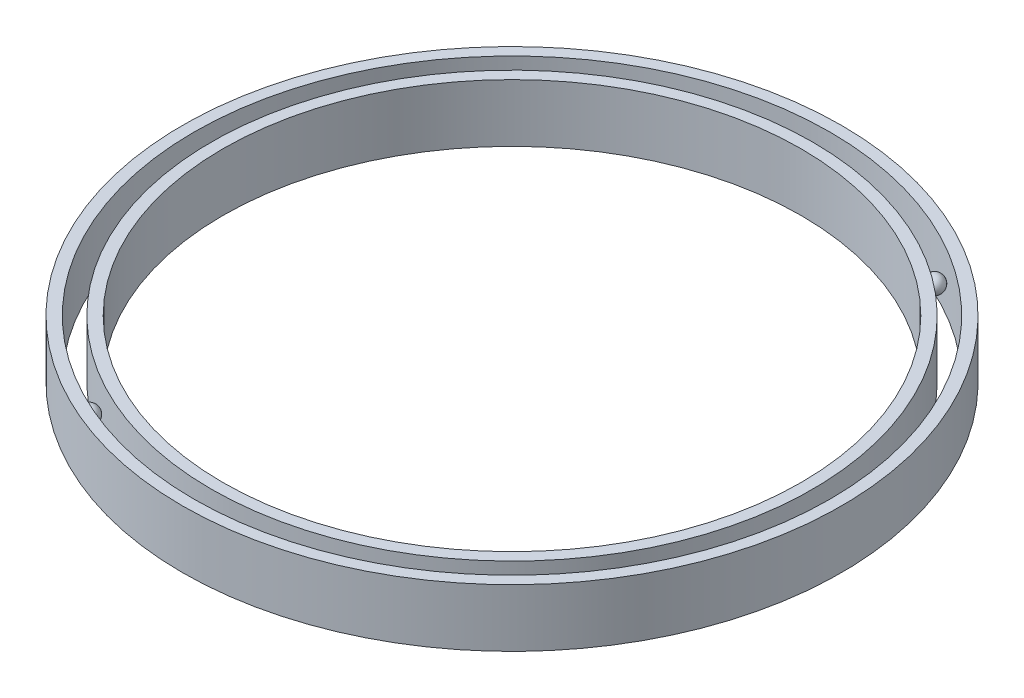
ISO-10303-21;
HEADER;
FILE_DESCRIPTION(('STEP AP214'),'2;1');
FILE_NAME('part.step','',(''),(''),'','','');
FILE_SCHEMA(('AUTOMOTIVE_DESIGN { 1 0 10303 214 1 1 1 1 }'));
ENDSEC;
DATA;
#1=APPLICATION_CONTEXT('core data for automotive mechanical design processes');
#2=APPLICATION_PROTOCOL_DEFINITION('international standard','automotive_design',2000,#1);
#3=PRODUCT_CONTEXT('',#1,'mechanical');
#4=PRODUCT('Part','Part','',(#3));
#5=PRODUCT_RELATED_PRODUCT_CATEGORY('part','',(#4));
#6=PRODUCT_DEFINITION_FORMATION('','',#4);
#7=PRODUCT_DEFINITION_CONTEXT('part definition',#1,'design');
#8=PRODUCT_DEFINITION('design','',#6,#7);
#9=PRODUCT_DEFINITION_SHAPE('','',#8);
#10=(LENGTH_UNIT() NAMED_UNIT(*) SI_UNIT(.MILLI.,.METRE.));
#11=(NAMED_UNIT(*) PLANE_ANGLE_UNIT() SI_UNIT($,.RADIAN.));
#12=(NAMED_UNIT(*) SI_UNIT($,.STERADIAN.) SOLID_ANGLE_UNIT());
#13=UNCERTAINTY_MEASURE_WITH_UNIT(LENGTH_MEASURE(1.E-05),#10,'distance_accuracy_value','');
#14=(GEOMETRIC_REPRESENTATION_CONTEXT(3) GLOBAL_UNCERTAINTY_ASSIGNED_CONTEXT((#13)) GLOBAL_UNIT_ASSIGNED_CONTEXT((#10,
#11,#12)) REPRESENTATION_CONTEXT('',''));
#15=CARTESIAN_POINT('',(0.,0.,0.));
#16=DIRECTION('',(0.,0.,1.));
#17=DIRECTION('',(1.,0.,0.));
#18=AXIS2_PLACEMENT_3D('',#15,#16,#17);
#19=CARTESIAN_POINT('',(53.5000000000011,0.,-92.6647182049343));
#20=DIRECTION('',(-0.50000000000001,0.,0.866025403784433));
#21=DIRECTION('',(0.866025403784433,0.,0.50000000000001));
#22=AXIS2_PLACEMENT_3D('',#19,#20,#21);
#23=SPHERICAL_SURFACE('',#22,3.);
#24=CARTESIAN_POINT('',(52.0000000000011,0.,-90.066641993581));
#25=VERTEX_POINT('',#24);
#26=VERTEX_LOOP('',#25);
#27=FACE_BOUND('',#26,.T.);
#28=ADVANCED_FACE('F36',(#27),#23,.T.);
#29=CLOSED_SHELL('',(#28));
#30=MANIFOLD_SOLID_BREP('B2',#29);
#31=CARTESIAN_POINT('',(-53.4999999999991,0.,-92.6647182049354));
#32=DIRECTION('',(0.499999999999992,0.,0.866025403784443));
#33=DIRECTION('',(0.866025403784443,0.,-0.499999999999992));
#34=AXIS2_PLACEMENT_3D('',#31,#32,#33);
#35=SPHERICAL_SURFACE('',#34,3.);
#36=CARTESIAN_POINT('',(-51.9999999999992,0.,-90.0666419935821));
#37=VERTEX_POINT('',#36);
#38=VERTEX_LOOP('',#37);
#39=FACE_BOUND('',#38,.T.);
#40=ADVANCED_FACE('F55',(#39),#35,.T.);
#41=CLOSED_SHELL('',(#40));
#42=MANIFOLD_SOLID_BREP('B6',#41);
#43=CARTESIAN_POINT('',(-107.,0.,0.));
#44=DIRECTION('',(1.,0.,0.));
#45=DIRECTION('',(0.,0.,-1.));
#46=AXIS2_PLACEMENT_3D('',#43,#44,#45);
#47=SPHERICAL_SURFACE('',#46,3.);
#48=CARTESIAN_POINT('',(-104.,0.,0.));
#49=VERTEX_POINT('',#48);
#50=VERTEX_LOOP('',#49);
#51=FACE_BOUND('',#50,.T.);
#52=ADVANCED_FACE('F74',(#51),#47,.T.);
#53=CLOSED_SHELL('',(#52));
#54=MANIFOLD_SOLID_BREP('B32',#53);
#55=CARTESIAN_POINT('',(-53.5000000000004,0.,92.6647182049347));
#56=DIRECTION('',(0.500000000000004,0.,-0.866025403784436));
#57=DIRECTION('',(-0.866025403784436,0.,-0.500000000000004));
#58=AXIS2_PLACEMENT_3D('',#55,#56,#57);
#59=SPHERICAL_SURFACE('',#58,3.);
#60=CARTESIAN_POINT('',(-52.0000000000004,0.,90.0666419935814));
#61=VERTEX_POINT('',#60);
#62=VERTEX_LOOP('',#61);
#63=FACE_BOUND('',#62,.T.);
#64=ADVANCED_FACE('F93',(#63),#59,.T.);
#65=CLOSED_SHELL('',(#64));
#66=MANIFOLD_SOLID_BREP('B51',#65);
#67=CARTESIAN_POINT('',(53.4999999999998,0.,92.6647182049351));
#68=DIRECTION('',(-0.499999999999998,0.,-0.86602540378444));
#69=DIRECTION('',(-0.86602540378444,0.,0.499999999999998));
#70=AXIS2_PLACEMENT_3D('',#67,#68,#69);
#71=SPHERICAL_SURFACE('',#70,3.);
#72=CARTESIAN_POINT('',(51.9999999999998,0.,90.0666419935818));
#73=VERTEX_POINT('',#72);
#74=VERTEX_LOOP('',#73);
#75=FACE_BOUND('',#74,.T.);
#76=ADVANCED_FACE('F112',(#75),#71,.T.);
#77=CLOSED_SHELL('',(#76));
#78=MANIFOLD_SOLID_BREP('B70',#77);
#79=CARTESIAN_POINT('',(107.,0.,0.));
#80=DIRECTION('',(-1.,0.,0.));
#81=DIRECTION('',(0.,0.,1.));
#82=AXIS2_PLACEMENT_3D('',#79,#80,#81);
#83=SPHERICAL_SURFACE('',#82,3.);
#84=CARTESIAN_POINT('',(104.,0.,0.));
#85=VERTEX_POINT('',#84);
#86=VERTEX_LOOP('',#85);
#87=FACE_BOUND('',#86,.T.);
#88=ADVANCED_FACE('F133',(#87),#83,.T.);
#89=CLOSED_SHELL('',(#88));
#90=MANIFOLD_SOLID_BREP('B89',#89);
#91=CARTESIAN_POINT('',(110.,10.,0.));
#92=DIRECTION('',(0.,1.,0.));
#93=DIRECTION('',(0.,0.,1.));
#94=AXIS2_PLACEMENT_3D('',#91,#92,#93);
#95=PLANE('',#94);
#96=CARTESIAN_POINT('',(0.,10.,0.));
#97=DIRECTION('',(0.,-1.,0.));
#98=DIRECTION('',(0.,0.,-1.));
#99=AXIS2_PLACEMENT_3D('',#96,#97,#98);
#100=CIRCLE('',#99,110.);
#101=CARTESIAN_POINT('',(0.,10.,-110.));
#102=VERTEX_POINT('',#101);
#103=EDGE_CURVE('E167',#102,#102,#100,.T.);
#104=ORIENTED_EDGE('',*,*,#103,.T.);
#105=EDGE_LOOP('',(#104));
#106=FACE_BOUND('',#105,.T.);
#107=CARTESIAN_POINT('',(0.,10.,0.));
#108=DIRECTION('',(0.,-1.,0.));
#109=DIRECTION('',(0.,0.,-1.));
#110=AXIS2_PLACEMENT_3D('',#107,#108,#109);
#111=CIRCLE('',#110,114.);
#112=CARTESIAN_POINT('',(0.,10.,-114.));
#113=VERTEX_POINT('',#112);
#114=EDGE_CURVE('E132',#113,#113,#111,.T.);
#115=ORIENTED_EDGE('',*,*,#114,.F.);
#116=EDGE_LOOP('',(#115));
#117=FACE_BOUND('',#116,.T.);
#118=ADVANCED_FACE('F153',(#106,#117),#95,.T.);
#119=CARTESIAN_POINT('',(0.,0.,0.));
#120=DIRECTION('',(0.,-1.,0.));
#121=DIRECTION('',(0.,0.,-1.));
#122=AXIS2_PLACEMENT_3D('',#119,#120,#121);
#123=CYLINDRICAL_SURFACE('',#122,114.);
#124=ORIENTED_EDGE('',*,*,#114,.T.);
#125=EDGE_LOOP('',(#124));
#126=FACE_BOUND('',#125,.T.);
#127=CARTESIAN_POINT('',(0.,-9.99999999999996,0.));
#128=DIRECTION('',(0.,-1.,0.));
#129=DIRECTION('',(0.,0.,-1.));
#130=AXIS2_PLACEMENT_3D('',#127,#128,#129);
#131=CIRCLE('',#130,114.);
#132=CARTESIAN_POINT('',(0.,-9.99999999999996,-114.));
#133=VERTEX_POINT('',#132);
#134=EDGE_CURVE('E159',#133,#133,#131,.T.);
#135=ORIENTED_EDGE('',*,*,#134,.F.);
#136=EDGE_LOOP('',(#135));
#137=FACE_BOUND('',#136,.T.);
#138=ADVANCED_FACE('F183',(#126,#137),#123,.T.);
#139=CARTESIAN_POINT('',(110.,-9.99999999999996,0.));
#140=DIRECTION('',(0.,-1.,0.));
#141=DIRECTION('',(0.,0.,-1.));
#142=AXIS2_PLACEMENT_3D('',#139,#140,#141);
#143=PLANE('',#142);
#144=ORIENTED_EDGE('',*,*,#134,.T.);
#145=EDGE_LOOP('',(#144));
#146=FACE_BOUND('',#145,.T.);
#147=CARTESIAN_POINT('',(0.,-9.99999999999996,0.));
#148=DIRECTION('',(0.,-1.,0.));
#149=DIRECTION('',(0.,0.,-1.));
#150=AXIS2_PLACEMENT_3D('',#147,#148,#149);
#151=CIRCLE('',#150,110.);
#152=CARTESIAN_POINT('',(0.,-9.99999999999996,-110.));
#153=VERTEX_POINT('',#152);
#154=EDGE_CURVE('E163',#153,#153,#151,.T.);
#155=ORIENTED_EDGE('',*,*,#154,.F.);
#156=EDGE_LOOP('',(#155));
#157=FACE_BOUND('',#156,.T.);
#158=ADVANCED_FACE('F177',(#146,#157),#143,.T.);
#159=CARTESIAN_POINT('',(0.,0.,0.));
#160=DIRECTION('',(0.,-1.,0.));
#161=DIRECTION('',(0.,0.,-1.));
#162=AXIS2_PLACEMENT_3D('',#159,#160,#161);
#163=CYLINDRICAL_SURFACE('',#162,110.);
#164=ORIENTED_EDGE('',*,*,#154,.T.);
#165=EDGE_LOOP('',(#164));
#166=FACE_BOUND('',#165,.T.);
#167=ORIENTED_EDGE('',*,*,#103,.F.);
#168=EDGE_LOOP('',(#167));
#169=FACE_BOUND('',#168,.T.);
#170=ADVANCED_FACE('F175',(#166,#169),#163,.F.);
#171=CLOSED_SHELL('',(#118,#138,#158,#170));
#172=MANIFOLD_SOLID_BREP('B108',#171);
#173=CARTESIAN_POINT('',(100.,10.,0.));
#174=DIRECTION('',(0.,1.,0.));
#175=DIRECTION('',(0.,0.,1.));
#176=AXIS2_PLACEMENT_3D('',#173,#174,#175);
#177=PLANE('',#176);
#178=CARTESIAN_POINT('',(0.,10.,0.));
#179=DIRECTION('',(0.,-1.,0.));
#180=DIRECTION('',(0.,0.,-1.));
#181=AXIS2_PLACEMENT_3D('',#178,#179,#180);
#182=CIRCLE('',#181,100.);
#183=CARTESIAN_POINT('',(0.,10.,-100.));
#184=VERTEX_POINT('',#183);
#185=EDGE_CURVE('E229',#184,#184,#182,.T.);
#186=ORIENTED_EDGE('',*,*,#185,.T.);
#187=EDGE_LOOP('',(#186));
#188=FACE_BOUND('',#187,.T.);
#189=CARTESIAN_POINT('',(0.,10.,0.));
#190=DIRECTION('',(0.,-1.,0.));
#191=DIRECTION('',(0.,0.,-1.));
#192=AXIS2_PLACEMENT_3D('',#189,#190,#191);
#193=CIRCLE('',#192,104.);
#194=CARTESIAN_POINT('',(0.,10.,-104.));
#195=VERTEX_POINT('',#194);
#196=EDGE_CURVE('E152',#195,#195,#193,.T.);
#197=ORIENTED_EDGE('',*,*,#196,.F.);
#198=EDGE_LOOP('',(#197));
#199=FACE_BOUND('',#198,.T.);
#200=ADVANCED_FACE('F215',(#188,#199),#177,.T.);
#201=CARTESIAN_POINT('',(0.,0.,0.));
#202=DIRECTION('',(0.,-1.,0.));
#203=DIRECTION('',(0.,0.,-1.));
#204=AXIS2_PLACEMENT_3D('',#201,#202,#203);
#205=CYLINDRICAL_SURFACE('',#204,104.);
#206=ORIENTED_EDGE('',*,*,#196,.T.);
#207=EDGE_LOOP('',(#206));
#208=FACE_BOUND('',#207,.T.);
#209=CARTESIAN_POINT('',(0.,-9.99999999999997,0.));
#210=DIRECTION('',(0.,-1.,0.));
#211=DIRECTION('',(0.,0.,-1.));
#212=AXIS2_PLACEMENT_3D('',#209,#210,#211);
#213=CIRCLE('',#212,104.);
#214=CARTESIAN_POINT('',(0.,-9.99999999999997,-104.));
#215=VERTEX_POINT('',#214);
#216=EDGE_CURVE('E221',#215,#215,#213,.T.);
#217=ORIENTED_EDGE('',*,*,#216,.F.);
#218=EDGE_LOOP('',(#217));
#219=FACE_BOUND('',#218,.T.);
#220=ADVANCED_FACE('F245',(#208,#219),#205,.T.);
#221=CARTESIAN_POINT('',(100.,-9.99999999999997,0.));
#222=DIRECTION('',(0.,-1.,0.));
#223=DIRECTION('',(0.,0.,-1.));
#224=AXIS2_PLACEMENT_3D('',#221,#222,#223);
#225=PLANE('',#224);
#226=ORIENTED_EDGE('',*,*,#216,.T.);
#227=EDGE_LOOP('',(#226));
#228=FACE_BOUND('',#227,.T.);
#229=CARTESIAN_POINT('',(0.,-9.99999999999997,0.));
#230=DIRECTION('',(0.,-1.,0.));
#231=DIRECTION('',(0.,0.,-1.));
#232=AXIS2_PLACEMENT_3D('',#229,#230,#231);
#233=CIRCLE('',#232,100.);
#234=CARTESIAN_POINT('',(0.,-9.99999999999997,-100.));
#235=VERTEX_POINT('',#234);
#236=EDGE_CURVE('E225',#235,#235,#233,.T.);
#237=ORIENTED_EDGE('',*,*,#236,.F.);
#238=EDGE_LOOP('',(#237));
#239=FACE_BOUND('',#238,.T.);
#240=ADVANCED_FACE('F239',(#228,#239),#225,.T.);
#241=CARTESIAN_POINT('',(0.,0.,0.));
#242=DIRECTION('',(0.,-1.,0.));
#243=DIRECTION('',(0.,0.,-1.));
#244=AXIS2_PLACEMENT_3D('',#241,#242,#243);
#245=CYLINDRICAL_SURFACE('',#244,100.);
#246=ORIENTED_EDGE('',*,*,#236,.T.);
#247=EDGE_LOOP('',(#246));
#248=FACE_BOUND('',#247,.T.);
#249=ORIENTED_EDGE('',*,*,#185,.F.);
#250=EDGE_LOOP('',(#249));
#251=FACE_BOUND('',#250,.T.);
#252=ADVANCED_FACE('F237',(#248,#251),#245,.F.);
#253=CLOSED_SHELL('',(#200,#220,#240,#252));
#254=MANIFOLD_SOLID_BREP('B127',#253);
#255=ADVANCED_BREP_SHAPE_REPRESENTATION('',(#18,#30,#42,#54,#66,#78,#90,#172,#254),#14);
#256=SHAPE_DEFINITION_REPRESENTATION(#9,#255);
ENDSEC;
END-ISO-10303-21;
